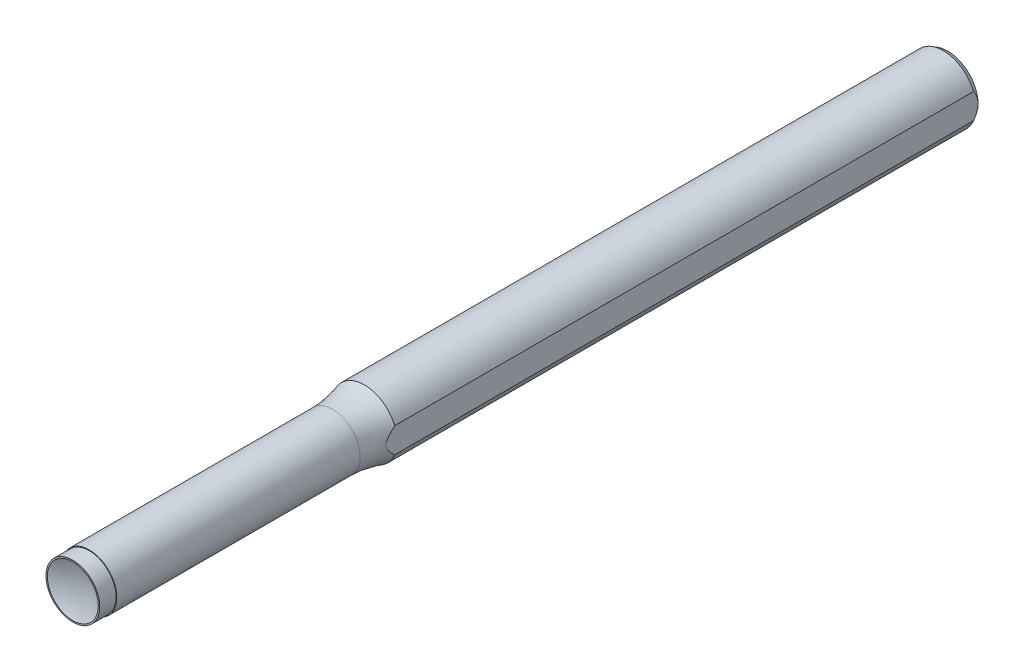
ISO-10303-21;
HEADER;
FILE_DESCRIPTION(('STEP AP214'),'2;1');
FILE_NAME('part.step','',(''),(''),'','','');
FILE_SCHEMA(('AUTOMOTIVE_DESIGN { 1 0 10303 214 1 1 1 1 }'));
ENDSEC;
DATA;
#1=APPLICATION_CONTEXT('core data for automotive mechanical design processes');
#2=APPLICATION_PROTOCOL_DEFINITION('international standard','automotive_design',2000,#1);
#3=PRODUCT_CONTEXT('',#1,'mechanical');
#4=PRODUCT('Part','Part','',(#3));
#5=PRODUCT_RELATED_PRODUCT_CATEGORY('part','',(#4));
#6=PRODUCT_DEFINITION_FORMATION('','',#4);
#7=PRODUCT_DEFINITION_CONTEXT('part definition',#1,'design');
#8=PRODUCT_DEFINITION('design','',#6,#7);
#9=PRODUCT_DEFINITION_SHAPE('','',#8);
#10=(LENGTH_UNIT() NAMED_UNIT(*) SI_UNIT(.MILLI.,.METRE.));
#11=(NAMED_UNIT(*) PLANE_ANGLE_UNIT() SI_UNIT($,.RADIAN.));
#12=(NAMED_UNIT(*) SI_UNIT($,.STERADIAN.) SOLID_ANGLE_UNIT());
#13=UNCERTAINTY_MEASURE_WITH_UNIT(LENGTH_MEASURE(1.E-05),#10,'distance_accuracy_value','');
#14=(GEOMETRIC_REPRESENTATION_CONTEXT(3) GLOBAL_UNCERTAINTY_ASSIGNED_CONTEXT((#13)) GLOBAL_UNIT_ASSIGNED_CONTEXT((#10,
#11,#12)) REPRESENTATION_CONTEXT('',''));
#15=CARTESIAN_POINT('',(0.,0.,0.));
#16=DIRECTION('',(0.,0.,1.));
#17=DIRECTION('',(1.,0.,0.));
#18=AXIS2_PLACEMENT_3D('',#15,#16,#17);
#19=CARTESIAN_POINT('',(0.,0.,-42.3333333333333));
#20=DIRECTION('',(0.,0.,1.));
#21=DIRECTION('',(1.,0.,0.));
#22=AXIS2_PLACEMENT_3D('',#19,#20,#21);
#23=CYLINDRICAL_SURFACE('',#22,4.);
#24=CARTESIAN_POINT('',(0.,0.,-37.7196444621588));
#25=DIRECTION('',(0.,0.,1.));
#26=DIRECTION('',(0.,-1.,0.));
#27=AXIS2_PLACEMENT_3D('',#24,#25,#26);
#28=CIRCLE('',#27,4.);
#29=CARTESIAN_POINT('',(0.,-4.,-37.7196444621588));
#30=VERTEX_POINT('',#29);
#31=EDGE_CURVE('E79',#30,#30,#28,.F.);
#32=ORIENTED_EDGE('',*,*,#31,.F.);
#33=EDGE_LOOP('',(#32));
#34=FACE_BOUND('',#33,.T.);
#35=CARTESIAN_POINT('',(0.,0.,-2.3825));
#36=DIRECTION('',(0.,0.,1.));
#37=DIRECTION('',(1.,0.,0.));
#38=AXIS2_PLACEMENT_3D('',#35,#36,#37);
#39=CIRCLE('',#38,4.);
#40=CARTESIAN_POINT('',(4.,0.,-2.3825));
#41=VERTEX_POINT('',#40);
#42=EDGE_CURVE('E90',#41,#41,#39,.F.);
#43=ORIENTED_EDGE('',*,*,#42,.T.);
#44=EDGE_LOOP('',(#43));
#45=FACE_BOUND('',#44,.T.);
#46=ADVANCED_FACE('F42',(#34,#45),#23,.T.);
#47=CARTESIAN_POINT('',(0.,0.,-2.3825));
#48=DIRECTION('',(0.,0.,1.));
#49=DIRECTION('',(1.,0.,0.));
#50=AXIS2_PLACEMENT_3D('',#47,#48,#49);
#51=PLANE('',#50);
#52=ORIENTED_EDGE('',*,*,#42,.F.);
#53=EDGE_LOOP('',(#52));
#54=FACE_BOUND('',#53,.T.);
#55=CARTESIAN_POINT('',(0.,0.,-2.3825));
#56=DIRECTION('',(0.,0.,1.));
#57=DIRECTION('',(1.,0.,0.));
#58=AXIS2_PLACEMENT_3D('',#55,#56,#57);
#59=CIRCLE('',#58,3.9);
#60=CARTESIAN_POINT('',(3.9,0.,-2.3825));
#61=VERTEX_POINT('',#60);
#62=EDGE_CURVE('E97',#61,#61,#59,.T.);
#63=ORIENTED_EDGE('',*,*,#62,.F.);
#64=EDGE_LOOP('',(#63));
#65=FACE_BOUND('',#64,.T.);
#66=ADVANCED_FACE('F109',(#54,#65),#51,.T.);
#67=CARTESIAN_POINT('',(0.,0.,-2.3825));
#68=DIRECTION('',(0.,0.,1.));
#69=DIRECTION('',(1.,0.,0.));
#70=AXIS2_PLACEMENT_3D('',#67,#68,#69);
#71=CYLINDRICAL_SURFACE('',#70,3.9);
#72=ORIENTED_EDGE('',*,*,#62,.T.);
#73=EDGE_LOOP('',(#72));
#74=FACE_BOUND('',#73,.T.);
#75=CARTESIAN_POINT('',(0.,0.,0.));
#76=DIRECTION('',(0.,0.,1.));
#77=DIRECTION('',(1.,0.,0.));
#78=AXIS2_PLACEMENT_3D('',#75,#76,#77);
#79=CIRCLE('',#78,3.9);
#80=CARTESIAN_POINT('',(3.9,0.,0.));
#81=VERTEX_POINT('',#80);
#82=EDGE_CURVE('E120',#81,#81,#79,.T.);
#83=ORIENTED_EDGE('',*,*,#82,.F.);
#84=EDGE_LOOP('',(#83));
#85=FACE_BOUND('',#84,.T.);
#86=ADVANCED_FACE('F115',(#74,#85),#71,.T.);
#87=CARTESIAN_POINT('',(0.,0.,0.));
#88=DIRECTION('',(0.,0.,1.));
#89=DIRECTION('',(1.,0.,0.));
#90=AXIS2_PLACEMENT_3D('',#87,#88,#89);
#91=PLANE('',#90);
#92=CARTESIAN_POINT('',(0.,0.,0.));
#93=DIRECTION('',(0.,0.,1.));
#94=DIRECTION('',(0.,-1.,0.));
#95=AXIS2_PLACEMENT_3D('',#92,#93,#94);
#96=CIRCLE('',#95,3.7);
#97=CARTESIAN_POINT('',(0.,-3.7,0.));
#98=VERTEX_POINT('',#97);
#99=EDGE_CURVE('E125',#98,#98,#96,.T.);
#100=ORIENTED_EDGE('',*,*,#99,.F.);
#101=EDGE_LOOP('',(#100));
#102=FACE_BOUND('',#101,.T.);
#103=ORIENTED_EDGE('',*,*,#82,.T.);
#104=EDGE_LOOP('',(#103));
#105=FACE_BOUND('',#104,.T.);
#106=ADVANCED_FACE('F157',(#102,#105),#91,.T.);
#107=CARTESIAN_POINT('',(0.,0.,8.78241993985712));
#108=DIRECTION('',(0.,0.,1.));
#109=DIRECTION('',(0.,-1.,0.));
#110=AXIS2_PLACEMENT_3D('',#107,#108,#109);
#111=SPHERICAL_SURFACE('',#110,9.53);
#112=ORIENTED_EDGE('',*,*,#99,.T.);
#113=EDGE_LOOP('',(#112));
#114=FACE_BOUND('',#113,.T.);
#115=ADVANCED_FACE('F160',(#114),#111,.F.);
#116=CARTESIAN_POINT('',(0.,0.,-37.7196444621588));
#117=DIRECTION('',(0.,0.,-1.));
#118=DIRECTION('',(0.,1.,0.));
#119=AXIS2_PLACEMENT_3D('',#116,#117,#118);
#120=TOROIDAL_SURFACE('',#119,18.295,14.295);
#121=CARTESIAN_POINT('',(4.39819012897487,7.39305228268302,-48.2268108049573));
#122=CARTESIAN_POINT('',(4.39819012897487,7.25062690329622,-48.1138997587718));
#123=CARTESIAN_POINT('',(4.39819012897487,7.10972512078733,-47.9990850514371));
#124=CARTESIAN_POINT('',(4.39819012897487,6.83094466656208,-47.7658620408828));
#125=CARTESIAN_POINT('',(4.39819012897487,6.69306576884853,-47.6474540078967));
#126=CARTESIAN_POINT('',(4.39819012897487,6.28407115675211,-47.2872892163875));
#127=CARTESIAN_POINT('',(4.39819012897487,6.01741428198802,-47.040445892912));
#128=CARTESIAN_POINT('',(4.39819012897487,5.49744487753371,-46.5369407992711));
#129=CARTESIAN_POINT('',(4.39819012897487,5.24404765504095,-46.2803659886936));
#130=CARTESIAN_POINT('',(4.39819012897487,4.74741270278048,-45.7576049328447));
#131=CARTESIAN_POINT('',(4.39819012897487,4.50417487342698,-45.4914187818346));
#132=CARTESIAN_POINT('',(4.39819012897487,4.02512728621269,-44.9504452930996));
#133=CARTESIAN_POINT('',(4.39819012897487,3.78935394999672,-44.6756259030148));
#134=CARTESIAN_POINT('',(4.39819012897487,3.43985340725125,-44.2597912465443));
#135=CARTESIAN_POINT('',(4.39819012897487,3.32401188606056,-44.1205358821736));
#136=CARTESIAN_POINT('',(4.39819012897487,3.09319164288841,-43.8413246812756));
#137=CARTESIAN_POINT('',(4.39819012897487,2.97821287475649,-43.7013688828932));
#138=CARTESIAN_POINT('',(4.39819012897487,2.74861676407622,-43.4215982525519));
#139=CARTESIAN_POINT('',(4.39819012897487,2.63399914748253,-43.2817836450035));
#140=CARTESIAN_POINT('',(4.39819012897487,2.40388001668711,-43.0028293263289));
#141=CARTESIAN_POINT('',(4.39819012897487,2.28837830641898,-42.8636897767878));
#142=CARTESIAN_POINT('',(4.39819012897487,2.05519630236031,-42.5875114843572));
#143=CARTESIAN_POINT('',(4.39819012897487,1.93751885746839,-42.4504703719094));
#144=CARTESIAN_POINT('',(4.39819012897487,1.75752834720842,-42.2480335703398));
#145=CARTESIAN_POINT('',(4.39819012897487,1.69696462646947,-42.1810882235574));
#146=CARTESIAN_POINT('',(4.39819012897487,1.57423413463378,-42.0486876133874));
#147=CARTESIAN_POINT('',(4.39819012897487,1.5120675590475,-41.9832321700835));
#148=CARTESIAN_POINT('',(4.39819012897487,1.40906002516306,-41.8783640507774));
#149=CARTESIAN_POINT('',(4.39819012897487,1.36887464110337,-41.8383085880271));
#150=CARTESIAN_POINT('',(4.39819012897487,1.28746505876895,-41.7592626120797));
#151=CARTESIAN_POINT('',(4.39819012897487,1.24624083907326,-41.7202721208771));
#152=CARTESIAN_POINT('',(4.39819012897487,1.16236634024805,-41.6434803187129));
#153=CARTESIAN_POINT('',(4.39819012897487,1.11971073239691,-41.6056847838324));
#154=CARTESIAN_POINT('',(4.39819012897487,1.03288449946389,-41.5318769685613));
#155=CARTESIAN_POINT('',(4.39819012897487,0.988713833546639,-41.4958647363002));
#156=CARTESIAN_POINT('',(4.39819012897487,0.852208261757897,-41.3902090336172));
#157=CARTESIAN_POINT('',(4.39819012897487,0.757067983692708,-41.3240769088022));
#158=CARTESIAN_POINT('',(4.39819012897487,0.557136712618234,-41.208893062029));
#159=CARTESIAN_POINT('',(4.39819012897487,0.45242788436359,-41.1597105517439));
#160=CARTESIAN_POINT('',(4.39819012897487,0.282177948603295,-41.1057629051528));
#161=CARTESIAN_POINT('',(4.39819012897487,0.219900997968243,-41.0909719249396));
#162=CARTESIAN_POINT('',(4.39819012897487,0.0936939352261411,-41.0724079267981));
#163=CARTESIAN_POINT('',(4.39819012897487,0.0297650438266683,-41.0686269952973));
#164=CARTESIAN_POINT('',(4.39819012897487,-0.0977515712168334,-41.0727068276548));
#165=CARTESIAN_POINT('',(4.39819012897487,-0.161339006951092,-41.0805762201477));
#166=CARTESIAN_POINT('',(4.39819012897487,-0.286294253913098,-41.1067036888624));
#167=CARTESIAN_POINT('',(4.39819012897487,-0.347660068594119,-41.1249708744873));
#168=CARTESIAN_POINT('',(4.39819012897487,-0.501691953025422,-41.1824790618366));
#169=CARTESIAN_POINT('',(4.39819012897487,-0.592071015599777,-41.2277404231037));
#170=CARTESIAN_POINT('',(4.39819012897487,-0.722053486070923,-41.3048349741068));
#171=CARTESIAN_POINT('',(4.39819012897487,-0.764565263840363,-41.3321598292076));
#172=CARTESIAN_POINT('',(4.39819012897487,-0.847929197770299,-41.3892306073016));
#173=CARTESIAN_POINT('',(4.39819012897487,-0.888781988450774,-41.4189755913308));
#174=CARTESIAN_POINT('',(4.39819012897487,-1.00459116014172,-41.5074994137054));
#175=CARTESIAN_POINT('',(4.39819012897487,-1.07770974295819,-41.5686622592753));
#176=CARTESIAN_POINT('',(4.39819012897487,-1.22019792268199,-41.6952397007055));
#177=CARTESIAN_POINT('',(4.39819012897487,-1.28956434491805,-41.7606577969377));
#178=CARTESIAN_POINT('',(4.39819012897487,-1.42568584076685,-41.8944721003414));
#179=CARTESIAN_POINT('',(4.39819012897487,-1.49243390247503,-41.9628753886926));
#180=CARTESIAN_POINT('',(4.39819012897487,-1.62389425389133,-42.1016184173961));
#181=CARTESIAN_POINT('',(4.39819012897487,-1.68860619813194,-42.1719584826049));
#182=CARTESIAN_POINT('',(4.39819012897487,-1.88171073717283,-42.3862204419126));
#183=CARTESIAN_POINT('',(4.39819012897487,-2.00786422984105,-42.5321499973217));
#184=CARTESIAN_POINT('',(4.39819012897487,-2.25711972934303,-42.8261675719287));
#185=CARTESIAN_POINT('',(4.39819012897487,-2.3802260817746,-42.9742519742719));
#186=CARTESIAN_POINT('',(4.39819012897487,-2.59741727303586,-43.2373751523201));
#187=CARTESIAN_POINT('',(4.39819012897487,-2.69171185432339,-43.3522406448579));
#188=CARTESIAN_POINT('',(4.39819012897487,-2.88025591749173,-43.582006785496));
#189=CARTESIAN_POINT('',(4.39819012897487,-2.97450539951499,-43.6969074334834));
#190=CARTESIAN_POINT('',(4.39819012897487,-3.25787430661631,-44.0411053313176));
#191=CARTESIAN_POINT('',(4.39819012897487,-3.44761317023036,-44.2698972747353));
#192=CARTESIAN_POINT('',(4.39819012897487,-3.83115227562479,-44.7240096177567));
#193=CARTESIAN_POINT('',(4.39819012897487,-4.02495186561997,-44.9493305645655));
#194=CARTESIAN_POINT('',(4.39819012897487,-4.41817550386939,-45.3950379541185));
#195=CARTESIAN_POINT('',(4.39819012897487,-4.61759965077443,-45.6154243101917));
#196=CARTESIAN_POINT('',(4.39819012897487,-5.01995810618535,-46.0466177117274));
#197=CARTESIAN_POINT('',(4.39819012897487,-5.22278955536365,-46.2575204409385));
#198=CARTESIAN_POINT('',(4.39819012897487,-5.63555659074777,-46.6722366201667));
#199=CARTESIAN_POINT('',(4.39819012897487,-5.84549157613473,-46.8760506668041));
#200=CARTESIAN_POINT('',(4.39819012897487,-6.27372520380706,-47.2763742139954));
#201=CARTESIAN_POINT('',(4.39819012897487,-6.4920524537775,-47.4728532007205));
#202=CARTESIAN_POINT('',(4.39819012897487,-6.93659909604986,-47.8568262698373));
#203=CARTESIAN_POINT('',(4.39819012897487,-7.16282128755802,-48.0443171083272));
#204=CARTESIAN_POINT('',(4.39819012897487,-7.39305228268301,-48.2268108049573));
#205=B_SPLINE_CURVE_WITH_KNOTS('',3,(#121,#122,#123,#124,#125,#126,#127,#128,#129,#130,#131,
#132,#133,#134,#135,#136,#137,#138,#139,#140,#141,#142,#143,#144,#145,#146,#147,#148,#149,#150,
#151,#152,#153,#154,#155,#156,#157,#158,#159,#160,#161,#162,#163,#164,#165,#166,#167,#168,#169,
#170,#171,#172,#173,#174,#175,#176,#177,#178,#179,#180,#181,#182,#183,#184,#185,#186,#187,#188,
#189,#190,#191,#192,#193,#194,#195,#196,#197,#198,#199,#200,#201,#202,#203,#204),.UNSPECIFIED.,
.F.,.F.,(4,2,2,2,2,2,2,2,2,2,2,2,2,2,2,2,2,2,2,2,2,2,2,2,2,2,2,2,2,2,2,2,2,2,2,2,2,2,2,2,2,4),
(0.,0.545220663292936,1.09040042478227,2.18005812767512,3.26158886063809,4.34310898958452,
5.42927777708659,5.97269267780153,6.51607829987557,7.05844977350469,7.60094523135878,
8.1427746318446,8.41358352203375,8.68435953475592,8.8545608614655,9.02476570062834,
9.19569590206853,9.36663071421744,9.71340111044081,10.0574324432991,10.2486324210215,
10.4396949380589,10.6308990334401,10.8222708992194,11.1236600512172,11.2752380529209,
11.4267575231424,11.7124610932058,11.9984027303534,12.2850640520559,12.5717737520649,
13.1503685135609,13.7280840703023,14.1739187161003,14.6197519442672,15.5114232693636,
16.4029525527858,17.2944974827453,18.1721738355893,19.0497761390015,19.9306948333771,
20.8119291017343),.UNSPECIFIED.);
#206=CARTESIAN_POINT('',(4.39819012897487,1.83334355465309,-42.3333333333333));
#207=VERTEX_POINT('',#206);
#208=CARTESIAN_POINT('',(4.39819012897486,-1.83334355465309,-42.3333333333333));
#209=VERTEX_POINT('',#208);
#210=EDGE_CURVE('E58',#207,#209,#205,.T.);
#211=ORIENTED_EDGE('',*,*,#210,.F.);
#212=CARTESIAN_POINT('',(0.,0.,-42.3333333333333));
#213=DIRECTION('',(0.,0.,-1.));
#214=DIRECTION('',(0.,1.,0.));
#215=AXIS2_PLACEMENT_3D('',#212,#213,#214);
#216=CIRCLE('',#215,4.765);
#217=EDGE_CURVE('E130',#209,#207,#216,.T.);
#218=ORIENTED_EDGE('',*,*,#217,.F.);
#219=EDGE_LOOP('',(#211,#218));
#220=FACE_BOUND('',#219,.T.);
#221=ORIENTED_EDGE('',*,*,#31,.T.);
#222=EDGE_LOOP('',(#221));
#223=FACE_BOUND('',#222,.T.);
#224=ADVANCED_FACE('F105',(#220,#223),#120,.F.);
#225=CARTESIAN_POINT('',(0.,0.,-127.));
#226=DIRECTION('',(0.,0.,1.));
#227=DIRECTION('',(1.,0.,0.));
#228=AXIS2_PLACEMENT_3D('',#225,#226,#227);
#229=PLANE('',#228);
#230=CARTESIAN_POINT('',(0.,0.,-127.));
#231=DIRECTION('',(0.,0.,1.));
#232=DIRECTION('',(1.,0.,0.));
#233=AXIS2_PLACEMENT_3D('',#230,#231,#232);
#234=CIRCLE('',#233,4.39819012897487);
#235=CARTESIAN_POINT('',(4.39819012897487,0.,-127.));
#236=VERTEX_POINT('',#235);
#237=EDGE_CURVE('E85',#236,#236,#234,.F.);
#238=ORIENTED_EDGE('',*,*,#237,.T.);
#239=EDGE_LOOP('',(#238));
#240=FACE_BOUND('',#239,.T.);
#241=ADVANCED_FACE('F155',(#240),#229,.F.);
#242=CARTESIAN_POINT('',(0.,0.,-126.364666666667));
#243=DIRECTION('',(0.,0.,1.));
#244=DIRECTION('',(1.,0.,0.));
#245=AXIS2_PLACEMENT_3D('',#242,#243,#244);
#246=CONICAL_SURFACE('',#245,4.765,0.523598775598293);
#247=CARTESIAN_POINT('',(4.39819012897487,-5.33423797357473,-122.64314394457));
#248=CARTESIAN_POINT('',(4.39819012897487,-5.23964449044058,-122.769540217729));
#249=CARTESIAN_POINT('',(4.39819012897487,-5.14441079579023,-122.895461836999));
#250=CARTESIAN_POINT('',(4.39819012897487,-4.95244135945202,-123.14617446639));
#251=CARTESIAN_POINT('',(4.39819012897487,-4.85570546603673,-123.270965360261));
#252=CARTESIAN_POINT('',(4.39819012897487,-4.66025992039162,-123.519551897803));
#253=CARTESIAN_POINT('',(4.39819012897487,-4.56154555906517,-123.643343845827));
#254=CARTESIAN_POINT('',(4.39819012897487,-4.36213663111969,-123.889318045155));
#255=CARTESIAN_POINT('',(4.39819012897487,-4.26144213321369,-124.01150035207));
#256=CARTESIAN_POINT('',(4.39819012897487,-4.05667136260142,-124.255205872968));
#257=CARTESIAN_POINT('',(4.39819012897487,-3.95257064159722,-124.376708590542));
#258=CARTESIAN_POINT('',(4.39819012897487,-3.74160194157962,-124.617285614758));
#259=CARTESIAN_POINT('',(4.39819012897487,-3.63473408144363,-124.73636002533));
#260=CARTESIAN_POINT('',(4.39819012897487,-3.41782749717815,-124.971366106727));
#261=CARTESIAN_POINT('',(4.39819012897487,-3.30779217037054,-125.087300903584));
#262=CARTESIAN_POINT('',(4.39819012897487,-3.08382779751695,-125.315332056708));
#263=CARTESIAN_POINT('',(4.39819012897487,-2.96989944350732,-125.427429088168));
#264=CARTESIAN_POINT('',(4.39819012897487,-2.77186488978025,-125.614120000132));
#265=CARTESIAN_POINT('',(4.39819012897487,-2.68894403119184,-125.68996971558));
#266=CARTESIAN_POINT('',(4.39819012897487,-2.52044667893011,-125.838685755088));
#267=CARTESIAN_POINT('',(4.39819012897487,-2.43486999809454,-125.911551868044));
#268=CARTESIAN_POINT('',(4.39819012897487,-2.26054924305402,-126.053736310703));
#269=CARTESIAN_POINT('',(4.39819012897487,-2.17179979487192,-126.123048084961));
#270=CARTESIAN_POINT('',(4.39819012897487,-1.99088174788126,-126.257087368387));
#271=CARTESIAN_POINT('',(4.39819012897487,-1.89871312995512,-126.321814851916));
#272=CARTESIAN_POINT('',(4.39819012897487,-1.7090542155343,-126.446513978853));
#273=CARTESIAN_POINT('',(4.39819012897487,-1.61150226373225,-126.506392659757));
#274=CARTESIAN_POINT('',(4.39819012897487,-1.41210644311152,-126.618657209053));
#275=CARTESIAN_POINT('',(4.39819012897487,-1.31026180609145,-126.671041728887));
#276=CARTESIAN_POINT('',(4.39819012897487,-1.10269294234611,-126.766129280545));
#277=CARTESIAN_POINT('',(4.39819012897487,-0.996989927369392,-126.808878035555));
#278=CARTESIAN_POINT('',(4.39819012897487,-0.781614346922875,-126.882793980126));
#279=CARTESIAN_POINT('',(4.39819012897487,-0.67194529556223,-126.913971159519));
#280=CARTESIAN_POINT('',(4.39819012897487,-0.488020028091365,-126.954270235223));
#281=CARTESIAN_POINT('',(4.39819012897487,-0.414608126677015,-126.967290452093));
#282=CARTESIAN_POINT('',(4.39819012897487,-0.266950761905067,-126.987044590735));
#283=CARTESIAN_POINT('',(4.39819012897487,-0.192705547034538,-126.993780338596));
#284=CARTESIAN_POINT('',(4.39819012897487,-0.0439156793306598,-127.000708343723));
#285=CARTESIAN_POINT('',(4.39819012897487,0.0306289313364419,-127.000901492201));
#286=CARTESIAN_POINT('',(4.39819012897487,0.179435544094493,-126.994754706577));
#287=CARTESIAN_POINT('',(4.39819012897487,0.253697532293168,-126.988414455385));
#288=CARTESIAN_POINT('',(4.39819012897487,0.474629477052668,-126.959962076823));
#289=CARTESIAN_POINT('',(4.39819012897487,0.620159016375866,-126.928448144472));
#290=CARTESIAN_POINT('',(4.39819012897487,0.904823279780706,-126.844288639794));
#291=CARTESIAN_POINT('',(4.39819012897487,1.04395187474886,-126.791623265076));
#292=CARTESIAN_POINT('',(4.39819012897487,1.30222792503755,-126.675763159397));
#293=CARTESIAN_POINT('',(4.39819012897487,1.42203206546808,-126.61399704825));
#294=CARTESIAN_POINT('',(4.39819012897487,1.65585339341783,-126.480248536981));
#295=CARTESIAN_POINT('',(4.39819012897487,1.76986529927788,-126.40825703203));
#296=CARTESIAN_POINT('',(4.39819012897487,1.99362460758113,-126.255843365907));
#297=CARTESIAN_POINT('',(4.39819012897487,2.10332163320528,-126.175348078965));
#298=CARTESIAN_POINT('',(4.39819012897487,2.31795882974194,-126.008389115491));
#299=CARTESIAN_POINT('',(4.39819012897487,2.42290098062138,-125.921927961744));
#300=CARTESIAN_POINT('',(4.39819012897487,2.66383353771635,-125.714113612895));
#301=CARTESIAN_POINT('',(4.39819012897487,2.79822037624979,-125.590909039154));
#302=CARTESIAN_POINT('',(4.39819012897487,3.0611757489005,-125.338408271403));
#303=CARTESIAN_POINT('',(4.39819012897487,3.18974214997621,-125.209109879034));
#304=CARTESIAN_POINT('',(4.39819012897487,3.44236417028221,-124.945697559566));
#305=CARTESIAN_POINT('',(4.39819012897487,3.56641012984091,-124.811574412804));
#306=CARTESIAN_POINT('',(4.39819012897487,3.81058734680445,-124.539807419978));
#307=CARTESIAN_POINT('',(4.39819012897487,3.93071829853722,-124.402163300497));
#308=CARTESIAN_POINT('',(4.39819012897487,4.16130930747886,-124.131643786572));
#309=CARTESIAN_POINT('',(4.39819012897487,4.27194072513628,-123.998913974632));
#310=CARTESIAN_POINT('',(4.39819012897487,4.49075134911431,-123.731440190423));
#311=CARTESIAN_POINT('',(4.39819012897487,4.59893042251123,-123.59669610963));
#312=CARTESIAN_POINT('',(4.39819012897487,4.81265144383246,-123.326247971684));
#313=CARTESIAN_POINT('',(4.39819012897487,4.91820400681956,-123.190552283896));
#314=CARTESIAN_POINT('',(4.39819012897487,5.12750213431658,-122.917805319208));
#315=CARTESIAN_POINT('',(4.39819012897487,5.23124796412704,-122.780754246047));
#316=CARTESIAN_POINT('',(4.39819012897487,5.33423797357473,-122.64314394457));
#317=B_SPLINE_CURVE_WITH_KNOTS('',3,(#247,#248,#249,#250,#251,#252,#253,#254,#255,#256,#257,
#258,#259,#260,#261,#262,#263,#264,#265,#266,#267,#268,#269,#270,#271,#272,#273,#274,#275,#276,
#277,#278,#279,#280,#281,#282,#283,#284,#285,#286,#287,#288,#289,#290,#291,#292,#293,#294,#295,
#296,#297,#298,#299,#300,#301,#302,#303,#304,#305,#306,#307,#308,#309,#310,#311,#312,#313,#314,
#315,#316),.UNSPECIFIED.,.F.,.F.,(4,2,2,2,2,2,2,2,2,2,2,2,2,2,2,2,2,2,2,2,2,2,2,2,2,2,2,2,2,2,2,
2,2,2,4),(0.,0.473622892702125,0.947293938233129,1.42227179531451,1.89723319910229,
2.37719719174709,2.85714059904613,3.33658712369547,3.81594885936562,4.15302867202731,
4.49013229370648,4.82783680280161,5.16554320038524,5.50866767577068,5.85185381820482,
6.19337550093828,6.53460165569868,6.75803376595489,6.98140093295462,7.20473767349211,
7.42808525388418,7.87266697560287,8.31766589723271,8.72141386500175,9.12552361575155,
9.53344563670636,9.94119620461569,10.4878713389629,11.0347452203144,11.5827263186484,
12.1307500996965,12.6490872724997,13.1674524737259,13.6831809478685,14.1988330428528),.UNSPECIFIED.);
#318=CARTESIAN_POINT('',(4.39819012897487,-1.83334355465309,-126.364666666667));
#319=VERTEX_POINT('',#318);
#320=EDGE_CURVE('E73',#319,#236,#317,.T.);
#321=ORIENTED_EDGE('',*,*,#320,.F.);
#322=CARTESIAN_POINT('',(0.,0.,-126.364666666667));
#323=DIRECTION('',(0.,0.,1.));
#324=DIRECTION('',(1.,0.,0.));
#325=AXIS2_PLACEMENT_3D('',#322,#323,#324);
#326=CIRCLE('',#325,4.765);
#327=CARTESIAN_POINT('',(4.39819012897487,1.83334355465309,-126.364666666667));
#328=VERTEX_POINT('',#327);
#329=EDGE_CURVE('E83',#328,#319,#326,.T.);
#330=ORIENTED_EDGE('',*,*,#329,.F.);
#331=EDGE_CURVE('E64',#236,#328,#317,.T.);
#332=ORIENTED_EDGE('',*,*,#331,.F.);
#333=ORIENTED_EDGE('',*,*,#237,.F.);
#334=EDGE_LOOP('',(#321,#330,#332,#333));
#335=FACE_BOUND('',#334,.T.);
#336=ADVANCED_FACE('F44',(#335),#246,.T.);
#337=CARTESIAN_POINT('',(0.,0.,-127.));
#338=DIRECTION('',(0.,0.,1.));
#339=DIRECTION('',(1.,0.,0.));
#340=AXIS2_PLACEMENT_3D('',#337,#338,#339);
#341=CYLINDRICAL_SURFACE('',#340,4.765);
#342=DIRECTION('',(0.,0.,1.));
#343=VECTOR('',#342,1.);
#344=CARTESIAN_POINT('',(4.39819012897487,1.83334355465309,-127.));
#345=LINE('',#344,#343);
#346=EDGE_CURVE('E13',#328,#207,#345,.T.);
#347=ORIENTED_EDGE('',*,*,#346,.F.);
#348=ORIENTED_EDGE('',*,*,#329,.T.);
#349=DIRECTION('',(0.,0.,1.));
#350=VECTOR('',#349,1.);
#351=CARTESIAN_POINT('',(4.39819012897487,-1.83334355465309,-127.));
#352=LINE('',#351,#350);
#353=EDGE_CURVE('E52',#209,#319,#352,.F.);
#354=ORIENTED_EDGE('',*,*,#353,.F.);
#355=ORIENTED_EDGE('',*,*,#217,.T.);
#356=EDGE_LOOP('',(#347,#348,#354,#355));
#357=FACE_BOUND('',#356,.T.);
#358=ADVANCED_FACE('F88',(#357),#341,.T.);
#359=CARTESIAN_POINT('',(4.39819012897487,1.83334355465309,0.));
#360=DIRECTION('',(-1.,0.,0.));
#361=DIRECTION('',(0.,0.,1.));
#362=AXIS2_PLACEMENT_3D('',#359,#360,#361);
#363=PLANE('',#362);
#364=ORIENTED_EDGE('',*,*,#210,.T.);
#365=ORIENTED_EDGE('',*,*,#353,.T.);
#366=ORIENTED_EDGE('',*,*,#320,.T.);
#367=ORIENTED_EDGE('',*,*,#331,.T.);
#368=ORIENTED_EDGE('',*,*,#346,.T.);
#369=EDGE_LOOP('',(#364,#365,#366,#367,#368));
#370=FACE_BOUND('',#369,.T.);
#371=ADVANCED_FACE('F72',(#370),#363,.F.);
#372=CLOSED_SHELL('',(#46,#66,#86,#106,#115,#224,#241,#336,#358,#371));
#373=MANIFOLD_SOLID_BREP('B2',#372);
#374=ADVANCED_BREP_SHAPE_REPRESENTATION('',(#18,#373),#14);
#375=SHAPE_DEFINITION_REPRESENTATION(#9,#374);
ENDSEC;
END-ISO-10303-21;
